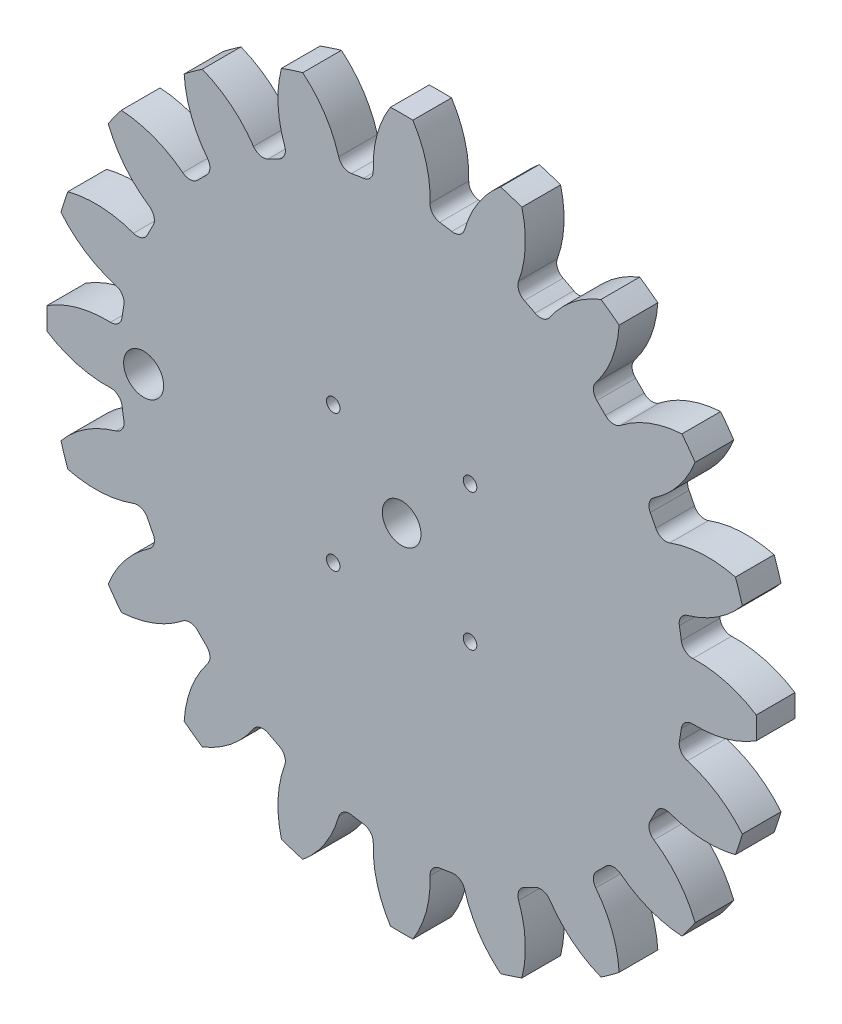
from build123d import *

# Parameters (mm, degrees)
BOSS_EXTRU_1_DEPTH                 = 6
CONG_1_R                           = 1.75
R_P_TITION_CIRCULAIRE4_COUNT       = 20
CONG_1_OF_R_P_TITION_CIRCULAIRE4_R = 1.75
ESQUISSE6_R                        = 3
ENL_V_MAT_EXTRU_1_DEPTH            = 10
ESQUISSE8_R                        = 1.05
ESQUISSE8_R_2                      = 3.1
ENL_V_MAT_EXTRU_3_DEPTH            = 79.012819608


with BuildPart() as part:
    # Esquisse3 → Boss.-Extru.1 (new body)
    with BuildSketch(Plane.XY):
        with BuildLine():
            Line((-6.844007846, 43.211364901), (0, 0))
            Line((0, 0), (6.844007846, 43.211364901))
            ThreePointArc((6.844007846, 43.211364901), (5.558296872, 43.395481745), (4.267687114, 43.541352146))
            ThreePointArc((4.267687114, 43.541352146), (4.008250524, 49.47966893), (1.736911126, 54.972567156))
            ThreePointArc((1.736911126, 54.972567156), (0, 55), (-1.736911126, 54.972567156))
            ThreePointArc((-1.736911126, 54.972567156), (-4.008250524, 49.47966893), (-4.267687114, 43.541352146))
            ThreePointArc((-4.267687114, 43.541352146), (-5.558296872, 43.395481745), (-6.844007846, 43.211364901))
        make_face()
    boss_extru_1 = extrude(amount=BOSS_EXTRU_1_DEPTH)

    # Cong_1
    cong_1_edges = [part.edges().sort_by_distance(p)[0] for p in [
        (-4.267687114, 43.541352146, 3),
        (4.267687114, 43.541352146, 3),
    ]]
    fillet(cong_1_edges, radius=CONG_1_R)

    # R_p_tition circulaire4: Boss.-Extru.1 ×20 about axis
    r_p_tition_circulaire4_axis = Axis((0, 0, 0), (0, 0, 1))
    for i in range(1, R_P_TITION_CIRCULAIRE4_COUNT):
        add(boss_extru_1.rotate(r_p_tition_circulaire4_axis, i * 360 / R_P_TITION_CIRCULAIRE4_COUNT))

    # Cong_1 of R_p_tition circulaire4
    cong_1_of_r_p_tition_circulaire4_edges = [part.edges().sort_by_distance(p)[0] for p in [
        (-17.513829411, 40.091498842, 3),
        (-9.396206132, 42.729074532, 3),
        (-29.045596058, 32.717210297, 3),
        (-22.140333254, 37.734177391, 3),
        (-37.734177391, 22.140333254, 3),
        (-32.717210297, 29.045596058, 3),
        (-42.729074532, 9.396206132, 3),
        (-40.091498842, 17.513829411, 3),
        (-43.541352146, -4.267687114, 3),
        (-43.541352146, 4.267687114, 3),
        (-40.091498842, -17.513829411, 3),
        (-42.729074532, -9.396206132, 3),
        (-32.717210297, -29.045596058, 3),
        (-37.734177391, -22.140333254, 3),
        (-22.140333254, -37.734177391, 3),
        (-29.045596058, -32.717210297, 3),
        (-9.396206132, -42.729074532, 3),
        (-17.513829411, -40.091498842, 3),
        (4.267687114, -43.541352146, 3),
        (-4.267687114, -43.541352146, 3),
        (17.513829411, -40.091498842, 3),
        (9.396206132, -42.729074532, 3),
        (29.045596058, -32.717210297, 3),
        (22.140333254, -37.734177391, 3),
        (37.734177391, -22.140333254, 3),
        (32.717210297, -29.045596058, 3),
        (42.729074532, -9.396206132, 3),
        (40.091498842, -17.513829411, 3),
        (43.541352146, 4.267687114, 3),
        (43.541352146, -4.267687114, 3),
        (40.091498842, 17.513829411, 3),
        (42.729074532, 9.396206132, 3),
        (32.717210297, 29.045596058, 3),
        (37.734177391, 22.140333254, 3),
        (22.140333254, 37.734177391, 3),
        (29.045596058, 32.717210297, 3),
        (9.396206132, 42.729074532, 3),
        (17.513829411, 40.091498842, 3),
    ]]
    fillet(cong_1_of_r_p_tition_circulaire4_edges, radius=CONG_1_OF_R_P_TITION_CIRCULAIRE4_R)

    # Esquisse6 → Enl_v. mat.-Extru.1 (cut)
    with BuildSketch(Plane.XY.offset(6)):
        Circle(ESQUISSE6_R)
    extrude(amount=-ENL_V_MAT_EXTRU_1_DEPTH, mode=Mode.SUBTRACT)

    # Esquisse8 → Enl_v. mat.-Extru.3 (cut, through all)
    with BuildSketch(Plane.XY.offset(6)):
        with Locations((-10.606601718, 10.606601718)):
            Circle(ESQUISSE8_R)
        with Locations((10.606601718, -10.606601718)):
            Circle(ESQUISSE8_R)
        with Locations((-10.606601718, -10.606601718)):
            Circle(ESQUISSE8_R)
        with Locations(Location((10.606601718, 10.606601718, 0), (0, 0, 180))):
            Circle(ESQUISSE8_R)
        with Locations((-40, 0)):
            Circle(ESQUISSE8_R_2)
    extrude(amount=-ENL_V_MAT_EXTRU_3_DEPTH, mode=Mode.SUBTRACT)


solid = part.part
